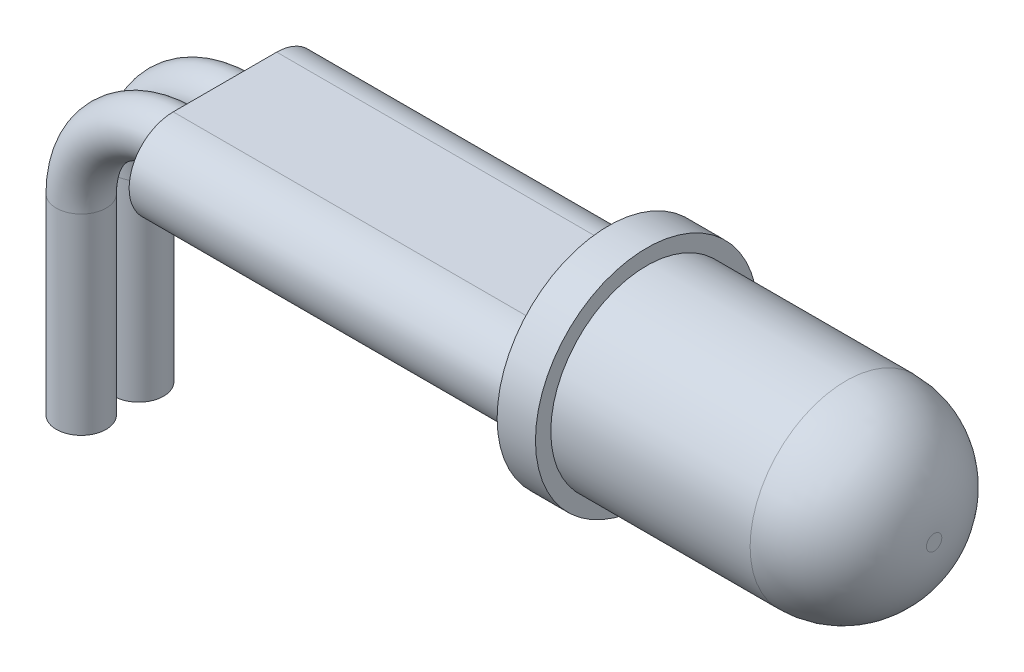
from build123d import *

# Parameters (mm, degrees)
BOSS_EXTRU_1_DEPTH = 10
ESQUISSE3_R        = 0.65


with BuildPart() as part:
    # Esquisse1 → R_volution1 (revolve)
    with BuildSketch(Plane.XY, mode=Mode.PRIVATE) as r_volution1_sk:
        with BuildLine():
            Line((0, 0), (0, 2.9))
            Line((0, 2.9), (1, 2.9))
            Line((1, 2.9), (1, 2.5))
            Line((1, 2.5), (6.2, 2.5))
            ThreePointArc((6.2, 2.5), (7.826345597, 1.826345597), (8.5, 0.2))
            Line((8.5, 0.2), (8.5, 0))
            Line((8.5, 0), (0, 0))
        make_face()
    revolve(r_volution1_sk.sketch.rotate(Axis((0, 0, 0), (1, 0, 0)), 90), axis=Axis((0, 0, 0), (1, 0, 0)))


with BuildPart() as body_2:
    # Esquisse2 → Boss.-Extru.1 (new body)
    with BuildSketch(Plane.ZY):
        with BuildLine():
            Line((-1.35, 1.15), (1.35, 1.15))
            ThreePointArc((1.35, 1.15), (2.5, 0), (1.35, -1.15))
            Line((1.35, -1.15), (-1.35, -1.15))
            ThreePointArc((-1.35, -1.15), (-2.5, 0), (-1.35, 1.15))
        make_face()
    extrude(amount=BOSS_EXTRU_1_DEPTH)

    # Balayage1: sweep along a path in Esquisse4
    with BuildLine(Plane(origin=(-10, 0, -0.75), x_dir=(1, 0, 0), z_dir=(0, 0, 1))) as balayage1_path:
        Line((0, 0), (-0.5, 0))
        ThreePointArc((-0.5, 0), (-2.267766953, -0.732233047), (-3, -2.5))
        Line((-3, -2.5), (-3, -7.5))
    # Esquisse3 → Balayage1 (sweep)
    with BuildSketch(Plane.ZY.offset(10)):
        with Locations((-0.75, 0)):
            Circle(ESQUISSE3_R)
        with Locations((0.75, 0)):
            Circle(ESQUISSE3_R)
    sweep(path=balayage1_path.line)


solid = Compound([part.part, body_2.part])
